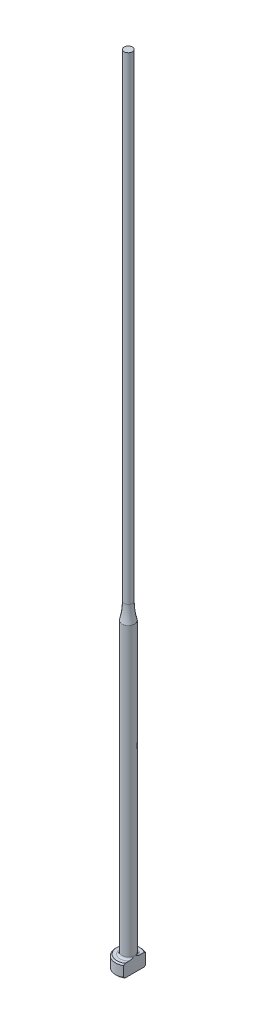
from build123d import *
from build123d.topology import SkipClean

# Parameters (mm, degrees)
CHAMFER1_SIZE = 0.2
FILLET1_R     = 0.3
KEY_DEPTH     = 126.031995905


with BuildPart() as part:
    # Sketch1 → Revolve1 (revolve)
    with BuildSketch(Plane.XY, mode=Mode.PRIVATE) as revolve1_sk:
        with BuildLine():
            Line((0, 0), (-2, 0))
            Line((-2, 0), (-2, 2))
            Line((-2, 2), (-1, 2))
            Line((-1, 2), (-1, 47.377501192))
            ThreePointArc((-1, 47.377501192), (-0.737886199, 48.677124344), (-0.65, 50))
            Line((-0.65, 50), (-0.65, 125))
            Line((-0.65, 125), (0, 125))
            Line((0, 125), (0, 0))
        make_face()
    revolve(revolve1_sk.sketch.rotate(Axis((0, 259.958771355, 0), (0, -1, 0)), 270), axis=Axis((0, 259.958771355, 0), (0, -1, 0)))

    # Chamfer1
    chamfer1_edges = [part.edges().sort_by_distance(p)[0] for p in [
        (0, 0, -2),
        (0, 2, -2),
    ]]
    chamfer(chamfer1_edges, length=CHAMFER1_SIZE)

    # Fillet1
    fillet1_edges = [part.edges().sort_by_distance(p)[0] for p in [
        (0, 2, -1),
    ]]
    fillet(fillet1_edges, radius=FILLET1_R)

    # Sketch2 → KEY (cut, through all)
    with SkipClean():  # the faces are left unmerged after this step: merging them gives an invalid solid
        with BuildSketch(Plane(origin=(0, 0, 0), x_dir=(1, 0, 0), z_dir=(0, 1, 0))):
            with BuildLine():
                Line((1, 1.732050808), (1, -1.732050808))
                ThreePointArc((1, -1.732050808), (2, 0), (1, 1.732050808))
            make_face()
        extrude(amount=KEY_DEPTH, mode=Mode.SUBTRACT)


solid = part.part
